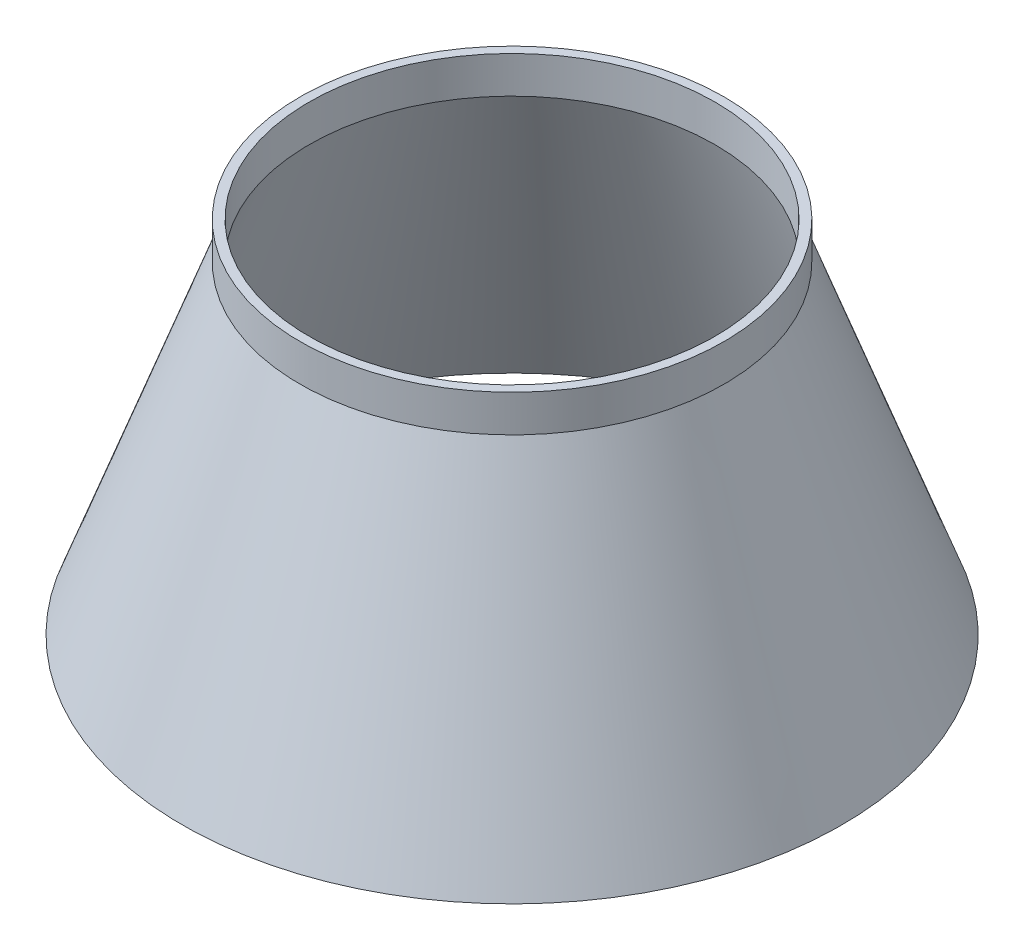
ISO-10303-21;
HEADER;
FILE_DESCRIPTION(('STEP AP214'),'2;1');
FILE_NAME('part.step','',(''),(''),'','','');
FILE_SCHEMA(('AUTOMOTIVE_DESIGN { 1 0 10303 214 1 1 1 1 }'));
ENDSEC;
DATA;
#1=APPLICATION_CONTEXT('core data for automotive mechanical design processes');
#2=APPLICATION_PROTOCOL_DEFINITION('international standard','automotive_design',2000,#1);
#3=PRODUCT_CONTEXT('',#1,'mechanical');
#4=PRODUCT('Part','Part','',(#3));
#5=PRODUCT_RELATED_PRODUCT_CATEGORY('part','',(#4));
#6=PRODUCT_DEFINITION_FORMATION('','',#4);
#7=PRODUCT_DEFINITION_CONTEXT('part definition',#1,'design');
#8=PRODUCT_DEFINITION('design','',#6,#7);
#9=PRODUCT_DEFINITION_SHAPE('','',#8);
#10=(LENGTH_UNIT() NAMED_UNIT(*) SI_UNIT(.MILLI.,.METRE.));
#11=(NAMED_UNIT(*) PLANE_ANGLE_UNIT() SI_UNIT($,.RADIAN.));
#12=(NAMED_UNIT(*) SI_UNIT($,.STERADIAN.) SOLID_ANGLE_UNIT());
#13=UNCERTAINTY_MEASURE_WITH_UNIT(LENGTH_MEASURE(1.E-05),#10,'distance_accuracy_value','');
#14=(GEOMETRIC_REPRESENTATION_CONTEXT(3) GLOBAL_UNCERTAINTY_ASSIGNED_CONTEXT((#13)) GLOBAL_UNIT_ASSIGNED_CONTEXT((#10,
#11,#12)) REPRESENTATION_CONTEXT('',''));
#15=CARTESIAN_POINT('',(0.,0.,0.));
#16=DIRECTION('',(0.,0.,1.));
#17=DIRECTION('',(1.,0.,0.));
#18=AXIS2_PLACEMENT_3D('',#15,#16,#17);
#19=CARTESIAN_POINT('',(0.,0.,0.));
#20=DIRECTION('',(0.,-1.,0.));
#21=DIRECTION('',(0.,0.,-1.));
#22=AXIS2_PLACEMENT_3D('',#19,#20,#21);
#23=CYLINDRICAL_SURFACE('',#22,47.);
#24=CARTESIAN_POINT('',(0.,79.8,0.));
#25=DIRECTION('',(0.,-1.,0.));
#26=DIRECTION('',(0.,0.,-1.));
#27=AXIS2_PLACEMENT_3D('',#24,#25,#26);
#28=CIRCLE('',#27,47.);
#29=CARTESIAN_POINT('',(0.,79.8,-47.));
#30=VERTEX_POINT('',#29);
#31=EDGE_CURVE('E55',#30,#30,#28,.T.);
#32=ORIENTED_EDGE('',*,*,#31,.T.);
#33=EDGE_LOOP('',(#32));
#34=FACE_BOUND('',#33,.T.);
#35=CARTESIAN_POINT('',(0.,71.6093221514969,0.));
#36=DIRECTION('',(0.,-1.,0.));
#37=DIRECTION('',(0.,0.,-1.));
#38=AXIS2_PLACEMENT_3D('',#35,#36,#37);
#39=CIRCLE('',#38,47.);
#40=CARTESIAN_POINT('',(0.,71.6093221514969,-47.));
#41=VERTEX_POINT('',#40);
#42=EDGE_CURVE('E10',#41,#41,#39,.T.);
#43=ORIENTED_EDGE('',*,*,#42,.F.);
#44=EDGE_LOOP('',(#43));
#45=FACE_BOUND('',#44,.T.);
#46=ADVANCED_FACE('F33',(#34,#45),#23,.T.);
#47=CARTESIAN_POINT('',(0.,0.,0.));
#48=DIRECTION('',(0.,-1.,0.));
#49=DIRECTION('',(0.,0.,-1.));
#50=AXIS2_PLACEMENT_3D('',#47,#48,#49);
#51=CONICAL_SURFACE('',#50,73.0636617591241,0.349065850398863);
#52=ORIENTED_EDGE('',*,*,#42,.T.);
#53=EDGE_LOOP('',(#52));
#54=FACE_BOUND('',#53,.T.);
#55=CARTESIAN_POINT('',(0.,0.,0.));
#56=DIRECTION('',(0.,-1.,0.));
#57=DIRECTION('',(0.,0.,-1.));
#58=AXIS2_PLACEMENT_3D('',#55,#56,#57);
#59=CIRCLE('',#58,73.0636617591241);
#60=CARTESIAN_POINT('',(0.,0.,-73.0636617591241));
#61=VERTEX_POINT('',#60);
#62=EDGE_CURVE('E39',#61,#61,#59,.T.);
#63=ORIENTED_EDGE('',*,*,#62,.F.);
#64=EDGE_LOOP('',(#63));
#65=FACE_BOUND('',#64,.T.);
#66=ADVANCED_FACE('F73',(#54,#65),#51,.T.);
#67=CARTESIAN_POINT('',(73.0636617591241,0.,0.));
#68=DIRECTION('',(0.,-1.,0.));
#69=DIRECTION('',(0.,0.,-1.));
#70=AXIS2_PLACEMENT_3D('',#67,#68,#69);
#71=PLANE('',#70);
#72=ORIENTED_EDGE('',*,*,#62,.T.);
#73=EDGE_LOOP('',(#72));
#74=FACE_BOUND('',#73,.T.);
#75=CARTESIAN_POINT('',(0.,0.,0.));
#76=DIRECTION('',(0.,-1.,0.));
#77=DIRECTION('',(0.,0.,-1.));
#78=AXIS2_PLACEMENT_3D('',#75,#76,#77);
#79=CIRCLE('',#78,71.0636617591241);
#80=CARTESIAN_POINT('',(0.,0.,-71.0636617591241));
#81=VERTEX_POINT('',#80);
#82=EDGE_CURVE('E43',#81,#81,#79,.T.);
#83=ORIENTED_EDGE('',*,*,#82,.F.);
#84=EDGE_LOOP('',(#83));
#85=FACE_BOUND('',#84,.T.);
#86=ADVANCED_FACE('F77',(#74,#85),#71,.T.);
#87=CARTESIAN_POINT('',(0.,71.6093221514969,0.));
#88=DIRECTION('',(0.,-1.,0.));
#89=DIRECTION('',(0.,0.,-1.));
#90=AXIS2_PLACEMENT_3D('',#87,#88,#89);
#91=CONICAL_SURFACE('',#90,45.,0.349065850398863);
#92=ORIENTED_EDGE('',*,*,#82,.T.);
#93=EDGE_LOOP('',(#92));
#94=FACE_BOUND('',#93,.T.);
#95=CARTESIAN_POINT('',(0.,71.6093221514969,0.));
#96=DIRECTION('',(0.,-1.,0.));
#97=DIRECTION('',(0.,0.,-1.));
#98=AXIS2_PLACEMENT_3D('',#95,#96,#97);
#99=CIRCLE('',#98,45.);
#100=CARTESIAN_POINT('',(0.,71.6093221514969,-45.));
#101=VERTEX_POINT('',#100);
#102=EDGE_CURVE('E47',#101,#101,#99,.T.);
#103=ORIENTED_EDGE('',*,*,#102,.F.);
#104=EDGE_LOOP('',(#103));
#105=FACE_BOUND('',#104,.T.);
#106=ADVANCED_FACE('F69',(#94,#105),#91,.F.);
#107=CARTESIAN_POINT('',(0.,0.,0.));
#108=DIRECTION('',(0.,-1.,0.));
#109=DIRECTION('',(0.,0.,-1.));
#110=AXIS2_PLACEMENT_3D('',#107,#108,#109);
#111=CYLINDRICAL_SURFACE('',#110,45.);
#112=ORIENTED_EDGE('',*,*,#102,.T.);
#113=EDGE_LOOP('',(#112));
#114=FACE_BOUND('',#113,.T.);
#115=CARTESIAN_POINT('',(0.,79.8,0.));
#116=DIRECTION('',(0.,-1.,0.));
#117=DIRECTION('',(0.,0.,-1.));
#118=AXIS2_PLACEMENT_3D('',#115,#116,#117);
#119=CIRCLE('',#118,45.);
#120=CARTESIAN_POINT('',(0.,79.8,-45.));
#121=VERTEX_POINT('',#120);
#122=EDGE_CURVE('E52',#121,#121,#119,.T.);
#123=ORIENTED_EDGE('',*,*,#122,.F.);
#124=EDGE_LOOP('',(#123));
#125=FACE_BOUND('',#124,.T.);
#126=ADVANCED_FACE('F63',(#114,#125),#111,.F.);
#127=CARTESIAN_POINT('',(45.,79.8,0.));
#128=DIRECTION('',(0.,1.,0.));
#129=DIRECTION('',(0.,0.,1.));
#130=AXIS2_PLACEMENT_3D('',#127,#128,#129);
#131=PLANE('',#130);
#132=ORIENTED_EDGE('',*,*,#122,.T.);
#133=EDGE_LOOP('',(#132));
#134=FACE_BOUND('',#133,.T.);
#135=ORIENTED_EDGE('',*,*,#31,.F.);
#136=EDGE_LOOP('',(#135));
#137=FACE_BOUND('',#136,.T.);
#138=ADVANCED_FACE('F61',(#134,#137),#131,.T.);
#139=CLOSED_SHELL('',(#46,#66,#86,#106,#126,#138));
#140=MANIFOLD_SOLID_BREP('B2',#139);
#141=ADVANCED_BREP_SHAPE_REPRESENTATION('',(#18,#140),#14);
#142=SHAPE_DEFINITION_REPRESENTATION(#9,#141);
ENDSEC;
END-ISO-10303-21;
